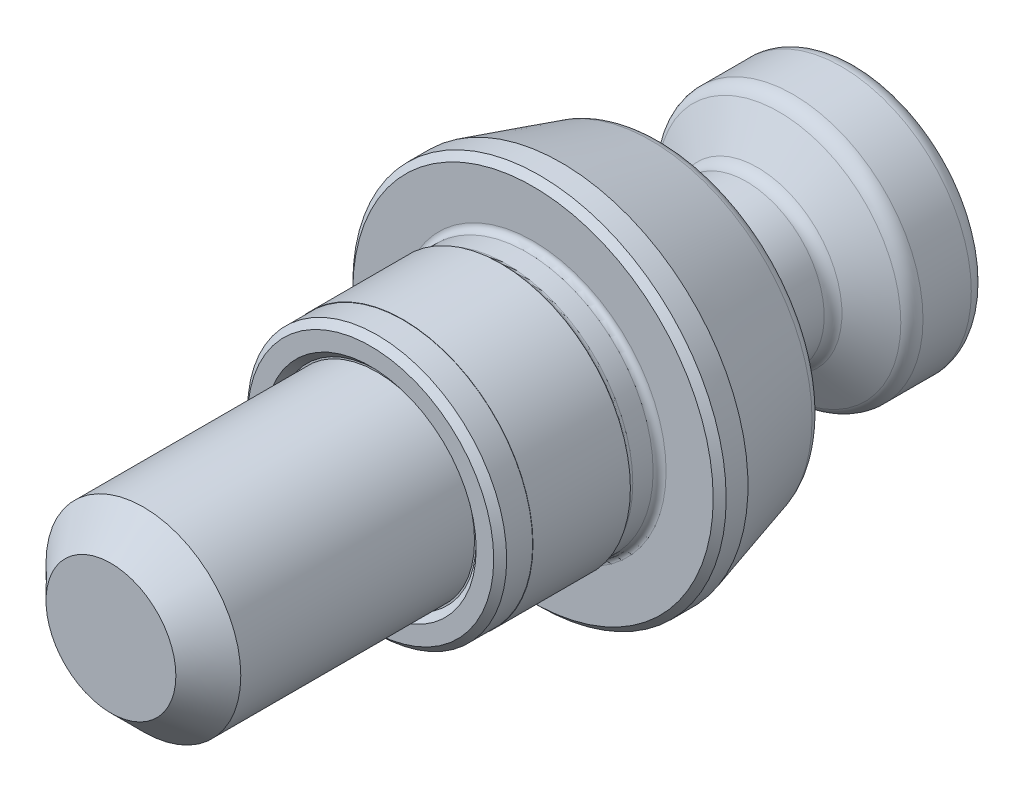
ISO-10303-21;
HEADER;
FILE_DESCRIPTION(('STEP AP214'),'2;1');
FILE_NAME('part.step','',(''),(''),'','','');
FILE_SCHEMA(('AUTOMOTIVE_DESIGN { 1 0 10303 214 1 1 1 1 }'));
ENDSEC;
DATA;
#1=APPLICATION_CONTEXT('core data for automotive mechanical design processes');
#2=APPLICATION_PROTOCOL_DEFINITION('international standard','automotive_design',2000,#1);
#3=PRODUCT_CONTEXT('',#1,'mechanical');
#4=PRODUCT('Part','Part','',(#3));
#5=PRODUCT_RELATED_PRODUCT_CATEGORY('part','',(#4));
#6=PRODUCT_DEFINITION_FORMATION('','',#4);
#7=PRODUCT_DEFINITION_CONTEXT('part definition',#1,'design');
#8=PRODUCT_DEFINITION('design','',#6,#7);
#9=PRODUCT_DEFINITION_SHAPE('','',#8);
#10=(LENGTH_UNIT() NAMED_UNIT(*) SI_UNIT(.MILLI.,.METRE.));
#11=(NAMED_UNIT(*) PLANE_ANGLE_UNIT() SI_UNIT($,.RADIAN.));
#12=(NAMED_UNIT(*) SI_UNIT($,.STERADIAN.) SOLID_ANGLE_UNIT());
#13=UNCERTAINTY_MEASURE_WITH_UNIT(LENGTH_MEASURE(1.E-05),#10,'distance_accuracy_value','');
#14=(GEOMETRIC_REPRESENTATION_CONTEXT(3) GLOBAL_UNCERTAINTY_ASSIGNED_CONTEXT((#13)) GLOBAL_UNIT_ASSIGNED_CONTEXT((#10,
#11,#12)) REPRESENTATION_CONTEXT('',''));
#15=CARTESIAN_POINT('',(0.,0.,0.));
#16=DIRECTION('',(0.,0.,1.));
#17=DIRECTION('',(1.,0.,0.));
#18=AXIS2_PLACEMENT_3D('',#15,#16,#17);
#19=CARTESIAN_POINT('',(0.,0.,0.));
#20=DIRECTION('',(0.,0.,1.));
#21=DIRECTION('',(1.,0.,0.));
#22=AXIS2_PLACEMENT_3D('',#19,#20,#21);
#23=CYLINDRICAL_SURFACE('',#22,4.05);
#24=CARTESIAN_POINT('',(0.,0.,-2.99580398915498));
#25=DIRECTION('',(0.,0.,-1.));
#26=DIRECTION('',(-1.,0.,0.));
#27=AXIS2_PLACEMENT_3D('',#24,#25,#26);
#28=CIRCLE('',#27,4.05);
#29=CARTESIAN_POINT('',(-4.05,0.,-2.99580398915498));
#30=VERTEX_POINT('',#29);
#31=EDGE_CURVE('E9',#30,#30,#28,.T.);
#32=ORIENTED_EDGE('',*,*,#31,.F.);
#33=EDGE_LOOP('',(#32));
#34=FACE_BOUND('',#33,.T.);
#35=CARTESIAN_POINT('',(0.,0.,-3.8));
#36=DIRECTION('',(0.,0.,-1.));
#37=DIRECTION('',(-1.,0.,0.));
#38=AXIS2_PLACEMENT_3D('',#35,#36,#37);
#39=CIRCLE('',#38,4.05);
#40=CARTESIAN_POINT('',(-4.05,0.,-3.8));
#41=VERTEX_POINT('',#40);
#42=EDGE_CURVE('E255',#41,#41,#39,.T.);
#43=ORIENTED_EDGE('',*,*,#42,.T.);
#44=EDGE_LOOP('',(#43));
#45=FACE_BOUND('',#44,.T.);
#46=ADVANCED_FACE('F14',(#34,#45),#23,.F.);
#47=CARTESIAN_POINT('',(0.,0.,0.2));
#48=DIRECTION('',(0.,0.,1.));
#49=DIRECTION('',(1.,0.,0.));
#50=AXIS2_PLACEMENT_3D('',#47,#48,#49);
#51=TOROIDAL_SURFACE('',#50,4.1,0.2);
#52=CARTESIAN_POINT('',(0.,0.,0.2));
#53=DIRECTION('',(0.,0.,1.));
#54=DIRECTION('',(1.,0.,0.));
#55=AXIS2_PLACEMENT_3D('',#52,#53,#54);
#56=CIRCLE('',#55,3.9);
#57=CARTESIAN_POINT('',(3.9,0.,0.2));
#58=VERTEX_POINT('',#57);
#59=EDGE_CURVE('E264',#58,#58,#56,.T.);
#60=ORIENTED_EDGE('',*,*,#59,.F.);
#61=EDGE_LOOP('',(#60));
#62=FACE_BOUND('',#61,.T.);
#63=CARTESIAN_POINT('',(0.,0.,0.));
#64=DIRECTION('',(0.,0.,1.));
#65=DIRECTION('',(1.,0.,0.));
#66=AXIS2_PLACEMENT_3D('',#63,#64,#65);
#67=CIRCLE('',#66,4.1);
#68=CARTESIAN_POINT('',(4.1,0.,0.));
#69=VERTEX_POINT('',#68);
#70=EDGE_CURVE('E258',#69,#69,#67,.F.);
#71=ORIENTED_EDGE('',*,*,#70,.F.);
#72=EDGE_LOOP('',(#71));
#73=FACE_BOUND('',#72,.T.);
#74=ADVANCED_FACE('F188',(#62,#73),#51,.F.);
#75=CARTESIAN_POINT('',(0.,4.,0.));
#76=DIRECTION('',(0.,0.,1.));
#77=DIRECTION('',(1.,0.,0.));
#78=AXIS2_PLACEMENT_3D('',#75,#76,#77);
#79=PLANE('',#78);
#80=ORIENTED_EDGE('',*,*,#70,.T.);
#81=EDGE_LOOP('',(#80));
#82=FACE_BOUND('',#81,.T.);
#83=CARTESIAN_POINT('',(0.,0.,0.));
#84=DIRECTION('',(0.,0.,1.));
#85=DIRECTION('',(1.,0.,0.));
#86=AXIS2_PLACEMENT_3D('',#83,#84,#85);
#87=CIRCLE('',#86,5.55);
#88=CARTESIAN_POINT('',(5.55,0.,0.));
#89=VERTEX_POINT('',#88);
#90=EDGE_CURVE('E243',#89,#89,#87,.T.);
#91=ORIENTED_EDGE('',*,*,#90,.T.);
#92=EDGE_LOOP('',(#91));
#93=FACE_BOUND('',#92,.T.);
#94=ADVANCED_FACE('F195',(#82,#93),#79,.T.);
#95=CARTESIAN_POINT('',(0.,0.,-0.199999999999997));
#96=DIRECTION('',(0.,0.,-1.));
#97=DIRECTION('',(-1.,0.,0.));
#98=AXIS2_PLACEMENT_3D('',#95,#96,#97);
#99=CONICAL_SURFACE('',#98,5.75,0.785398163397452);
#100=ORIENTED_EDGE('',*,*,#90,.F.);
#101=EDGE_LOOP('',(#100));
#102=FACE_BOUND('',#101,.T.);
#103=CARTESIAN_POINT('',(0.,0.,-0.199999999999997));
#104=DIRECTION('',(0.,0.,1.));
#105=DIRECTION('',(1.,0.,0.));
#106=AXIS2_PLACEMENT_3D('',#103,#104,#105);
#107=CIRCLE('',#106,5.75);
#108=CARTESIAN_POINT('',(5.75,0.,-0.199999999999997));
#109=VERTEX_POINT('',#108);
#110=EDGE_CURVE('E240',#109,#109,#107,.F.);
#111=ORIENTED_EDGE('',*,*,#110,.F.);
#112=EDGE_LOOP('',(#111));
#113=FACE_BOUND('',#112,.T.);
#114=ADVANCED_FACE('F472',(#102,#113),#99,.T.);
#115=CARTESIAN_POINT('',(0.,0.,0.));
#116=DIRECTION('',(0.,0.,-1.));
#117=DIRECTION('',(-1.,0.,0.));
#118=AXIS2_PLACEMENT_3D('',#115,#116,#117);
#119=CYLINDRICAL_SURFACE('',#118,5.75);
#120=ORIENTED_EDGE('',*,*,#110,.T.);
#121=EDGE_LOOP('',(#120));
#122=FACE_BOUND('',#121,.T.);
#123=CARTESIAN_POINT('',(0.,0.,-0.871853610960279));
#124=DIRECTION('',(0.,0.,-1.));
#125=DIRECTION('',(-1.,0.,0.));
#126=AXIS2_PLACEMENT_3D('',#123,#124,#125);
#127=CIRCLE('',#126,5.75);
#128=CARTESIAN_POINT('',(-5.75,0.,-0.871853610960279));
#129=VERTEX_POINT('',#128);
#130=EDGE_CURVE('E231',#129,#129,#127,.T.);
#131=ORIENTED_EDGE('',*,*,#130,.F.);
#132=EDGE_LOOP('',(#131));
#133=FACE_BOUND('',#132,.T.);
#134=ADVANCED_FACE('F475',(#122,#133),#119,.T.);
#135=CARTESIAN_POINT('',(0.,0.,-4.));
#136=DIRECTION('',(0.,0.,1.));
#137=DIRECTION('',(1.,0.,0.));
#138=AXIS2_PLACEMENT_3D('',#135,#136,#137);
#139=CONICAL_SURFACE('',#138,4.85301845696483,0.279252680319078);
#140=CARTESIAN_POINT('',(0.,0.,-3.63781867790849));
#141=DIRECTION('',(0.,0.,-1.));
#142=DIRECTION('',(-1.,0.,0.));
#143=AXIS2_PLACEMENT_3D('',#140,#141,#142);
#144=CIRCLE('',#143,4.95687227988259);
#145=CARTESIAN_POINT('',(-4.95687227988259,0.,-3.63781867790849));
#146=VERTEX_POINT('',#145);
#147=EDGE_CURVE('E237',#146,#146,#144,.F.);
#148=ORIENTED_EDGE('',*,*,#147,.T.);
#149=EDGE_LOOP('',(#148));
#150=FACE_BOUND('',#149,.T.);
#151=ORIENTED_EDGE('',*,*,#130,.T.);
#152=EDGE_LOOP('',(#151));
#153=FACE_BOUND('',#152,.T.);
#154=ADVANCED_FACE('F480',(#150,#153),#139,.T.);
#155=CARTESIAN_POINT('',(0.,0.,-3.5));
#156=DIRECTION('',(0.,0.,-1.));
#157=DIRECTION('',(-1.,0.,0.));
#158=AXIS2_PLACEMENT_3D('',#155,#156,#157);
#159=TOROIDAL_SURFACE('',#158,4.47624143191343,0.5);
#160=ORIENTED_EDGE('',*,*,#147,.F.);
#161=EDGE_LOOP('',(#160));
#162=FACE_BOUND('',#161,.T.);
#163=CARTESIAN_POINT('',(0.,0.,-4.));
#164=DIRECTION('',(0.,0.,-1.));
#165=DIRECTION('',(-1.,0.,0.));
#166=AXIS2_PLACEMENT_3D('',#163,#164,#165);
#167=CIRCLE('',#166,4.47624143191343);
#168=CARTESIAN_POINT('',(-4.47624143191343,0.,-4.));
#169=VERTEX_POINT('',#168);
#170=EDGE_CURVE('E234',#169,#169,#167,.T.);
#171=ORIENTED_EDGE('',*,*,#170,.F.);
#172=EDGE_LOOP('',(#171));
#173=FACE_BOUND('',#172,.T.);
#174=ADVANCED_FACE('F477',(#162,#173),#159,.T.);
#175=CARTESIAN_POINT('',(0.,3.05,-4.));
#176=DIRECTION('',(0.,0.,-1.));
#177=DIRECTION('',(-1.,0.,0.));
#178=AXIS2_PLACEMENT_3D('',#175,#176,#177);
#179=PLANE('',#178);
#180=CARTESIAN_POINT('',(0.,0.,-4.));
#181=DIRECTION('',(0.,0.,-1.));
#182=DIRECTION('',(-1.,0.,0.));
#183=AXIS2_PLACEMENT_3D('',#180,#181,#182);
#184=CIRCLE('',#183,4.25);
#185=CARTESIAN_POINT('',(-4.25,0.,-4.));
#186=VERTEX_POINT('',#185);
#187=EDGE_CURVE('E252',#186,#186,#184,.F.);
#188=ORIENTED_EDGE('',*,*,#187,.T.);
#189=EDGE_LOOP('',(#188));
#190=FACE_BOUND('',#189,.T.);
#191=ORIENTED_EDGE('',*,*,#170,.T.);
#192=EDGE_LOOP('',(#191));
#193=FACE_BOUND('',#192,.T.);
#194=ADVANCED_FACE('F465',(#190,#193),#179,.T.);
#195=CARTESIAN_POINT('',(0.,0.,-4.));
#196=DIRECTION('',(0.,0.,-1.));
#197=DIRECTION('',(-1.,0.,0.));
#198=AXIS2_PLACEMENT_3D('',#195,#196,#197);
#199=CONICAL_SURFACE('',#198,4.25,0.785398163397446);
#200=ORIENTED_EDGE('',*,*,#42,.F.);
#201=EDGE_LOOP('',(#200));
#202=FACE_BOUND('',#201,.T.);
#203=ORIENTED_EDGE('',*,*,#187,.F.);
#204=EDGE_LOOP('',(#203));
#205=FACE_BOUND('',#204,.T.);
#206=ADVANCED_FACE('F462',(#202,#205),#199,.F.);
#207=CARTESIAN_POINT('',(0.,0.,0.));
#208=DIRECTION('',(0.,0.,-1.));
#209=DIRECTION('',(-1.,0.,0.));
#210=AXIS2_PLACEMENT_3D('',#207,#208,#209);
#211=CYLINDRICAL_SURFACE('',#210,3.9);
#212=ORIENTED_EDGE('',*,*,#59,.T.);
#213=EDGE_LOOP('',(#212));
#214=FACE_BOUND('',#213,.T.);
#215=CARTESIAN_POINT('',(0.,0.,0.826794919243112));
#216=DIRECTION('',(0.,0.,1.));
#217=DIRECTION('',(1.,0.,0.));
#218=AXIS2_PLACEMENT_3D('',#215,#216,#217);
#219=CIRCLE('',#218,3.9);
#220=CARTESIAN_POINT('',(3.9,0.,0.826794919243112));
#221=VERTEX_POINT('',#220);
#222=EDGE_CURVE('E261',#221,#221,#219,.F.);
#223=ORIENTED_EDGE('',*,*,#222,.T.);
#224=EDGE_LOOP('',(#223));
#225=FACE_BOUND('',#224,.T.);
#226=ADVANCED_FACE('F459',(#214,#225),#211,.T.);
#227=CARTESIAN_POINT('',(0.,0.,0.826794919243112));
#228=DIRECTION('',(0.,0.,1.));
#229=DIRECTION('',(1.,0.,0.));
#230=AXIS2_PLACEMENT_3D('',#227,#228,#229);
#231=TOROIDAL_SURFACE('',#230,4.1,0.2);
#232=CARTESIAN_POINT('',(0.,0.,1.));
#233=DIRECTION('',(0.,0.,-1.));
#234=DIRECTION('',(-1.,0.,0.));
#235=AXIS2_PLACEMENT_3D('',#232,#233,#234);
#236=CIRCLE('',#235,4.);
#237=CARTESIAN_POINT('',(-4.,0.,1.));
#238=VERTEX_POINT('',#237);
#239=EDGE_CURVE('E216',#238,#238,#236,.T.);
#240=ORIENTED_EDGE('',*,*,#239,.T.);
#241=EDGE_LOOP('',(#240));
#242=FACE_BOUND('',#241,.T.);
#243=ORIENTED_EDGE('',*,*,#222,.F.);
#244=EDGE_LOOP('',(#243));
#245=FACE_BOUND('',#244,.T.);
#246=ADVANCED_FACE('F456',(#242,#245),#231,.F.);
#247=CARTESIAN_POINT('',(0.,0.,0.));
#248=DIRECTION('',(0.,0.,-1.));
#249=DIRECTION('',(-1.,0.,0.));
#250=AXIS2_PLACEMENT_3D('',#247,#248,#249);
#251=CYLINDRICAL_SURFACE('',#250,4.);
#252=CARTESIAN_POINT('',(0.,0.,4.));
#253=DIRECTION('',(0.,0.,-1.));
#254=DIRECTION('',(-1.,0.,0.));
#255=AXIS2_PLACEMENT_3D('',#252,#253,#254);
#256=CIRCLE('',#255,4.);
#257=CARTESIAN_POINT('',(-4.,0.,4.));
#258=VERTEX_POINT('',#257);
#259=EDGE_CURVE('E228',#258,#258,#256,.T.);
#260=ORIENTED_EDGE('',*,*,#259,.T.);
#261=EDGE_LOOP('',(#260));
#262=FACE_BOUND('',#261,.T.);
#263=ORIENTED_EDGE('',*,*,#239,.F.);
#264=EDGE_LOOP('',(#263));
#265=FACE_BOUND('',#264,.T.);
#266=ADVANCED_FACE('F458',(#262,#265),#251,.T.);
#267=CARTESIAN_POINT('',(0.,-4.,4.));
#268=DIRECTION('',(0.,0.,1.));
#269=DIRECTION('',(1.,0.,0.));
#270=AXIS2_PLACEMENT_3D('',#267,#268,#269);
#271=PLANE('',#270);
#272=CARTESIAN_POINT('',(0.,0.,4.));
#273=DIRECTION('',(0.,0.,-1.));
#274=DIRECTION('',(-1.,0.,0.));
#275=AXIS2_PLACEMENT_3D('',#272,#273,#274);
#276=CIRCLE('',#275,3.99);
#277=CARTESIAN_POINT('',(-3.99,0.,4.));
#278=VERTEX_POINT('',#277);
#279=EDGE_CURVE('E220',#278,#278,#276,.T.);
#280=ORIENTED_EDGE('',*,*,#279,.T.);
#281=EDGE_LOOP('',(#280));
#282=FACE_BOUND('',#281,.T.);
#283=ORIENTED_EDGE('',*,*,#259,.F.);
#284=EDGE_LOOP('',(#283));
#285=FACE_BOUND('',#284,.T.);
#286=ADVANCED_FACE('F484',(#282,#285),#271,.T.);
#287=CARTESIAN_POINT('',(0.,0.,0.));
#288=DIRECTION('',(0.,0.,-1.));
#289=DIRECTION('',(-1.,0.,0.));
#290=AXIS2_PLACEMENT_3D('',#287,#288,#289);
#291=CYLINDRICAL_SURFACE('',#290,3.99);
#292=CARTESIAN_POINT('',(0.,0.,4.8));
#293=DIRECTION('',(0.,0.,1.));
#294=DIRECTION('',(1.,0.,0.));
#295=AXIS2_PLACEMENT_3D('',#292,#293,#294);
#296=CIRCLE('',#295,3.99);
#297=CARTESIAN_POINT('',(3.99,0.,4.8));
#298=VERTEX_POINT('',#297);
#299=EDGE_CURVE('E246',#298,#298,#296,.F.);
#300=ORIENTED_EDGE('',*,*,#299,.T.);
#301=EDGE_LOOP('',(#300));
#302=FACE_BOUND('',#301,.T.);
#303=ORIENTED_EDGE('',*,*,#279,.F.);
#304=EDGE_LOOP('',(#303));
#305=FACE_BOUND('',#304,.T.);
#306=ADVANCED_FACE('F470',(#302,#305),#291,.T.);
#307=CARTESIAN_POINT('',(0.,0.,4.8));
#308=DIRECTION('',(0.,0.,-1.));
#309=DIRECTION('',(-1.,0.,0.));
#310=AXIS2_PLACEMENT_3D('',#307,#308,#309);
#311=CONICAL_SURFACE('',#310,3.99,0.785398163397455);
#312=CARTESIAN_POINT('',(0.,0.,5.));
#313=DIRECTION('',(0.,0.,1.));
#314=DIRECTION('',(1.,0.,0.));
#315=AXIS2_PLACEMENT_3D('',#312,#313,#314);
#316=CIRCLE('',#315,3.79);
#317=CARTESIAN_POINT('',(3.79,0.,5.));
#318=VERTEX_POINT('',#317);
#319=EDGE_CURVE('E249',#318,#318,#316,.T.);
#320=ORIENTED_EDGE('',*,*,#319,.F.);
#321=EDGE_LOOP('',(#320));
#322=FACE_BOUND('',#321,.T.);
#323=ORIENTED_EDGE('',*,*,#299,.F.);
#324=EDGE_LOOP('',(#323));
#325=FACE_BOUND('',#324,.T.);
#326=ADVANCED_FACE('F467',(#322,#325),#311,.T.);
#327=CARTESIAN_POINT('',(0.,3.05,5.));
#328=DIRECTION('',(0.,0.,1.));
#329=DIRECTION('',(1.,0.,0.));
#330=AXIS2_PLACEMENT_3D('',#327,#328,#329);
#331=PLANE('',#330);
#332=CARTESIAN_POINT('',(0.,0.,5.));
#333=DIRECTION('',(0.,0.,1.));
#334=DIRECTION('',(1.,0.,0.));
#335=AXIS2_PLACEMENT_3D('',#332,#333,#334);
#336=CIRCLE('',#335,3.25);
#337=CARTESIAN_POINT('',(3.25,0.,5.));
#338=VERTEX_POINT('',#337);
#339=EDGE_CURVE('E270',#338,#338,#336,.F.);
#340=ORIENTED_EDGE('',*,*,#339,.T.);
#341=EDGE_LOOP('',(#340));
#342=FACE_BOUND('',#341,.T.);
#343=ORIENTED_EDGE('',*,*,#319,.T.);
#344=EDGE_LOOP('',(#343));
#345=FACE_BOUND('',#344,.T.);
#346=ADVANCED_FACE('F454',(#342,#345),#331,.T.);
#347=CARTESIAN_POINT('',(0.,0.,5.));
#348=DIRECTION('',(0.,0.,1.));
#349=DIRECTION('',(1.,0.,0.));
#350=AXIS2_PLACEMENT_3D('',#347,#348,#349);
#351=CONICAL_SURFACE('',#350,3.25,0.785398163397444);
#352=CARTESIAN_POINT('',(0.,0.,4.8));
#353=DIRECTION('',(0.,0.,1.));
#354=DIRECTION('',(1.,0.,0.));
#355=AXIS2_PLACEMENT_3D('',#352,#353,#354);
#356=CIRCLE('',#355,3.05);
#357=CARTESIAN_POINT('',(3.05,0.,4.8));
#358=VERTEX_POINT('',#357);
#359=EDGE_CURVE('E267',#358,#358,#356,.T.);
#360=ORIENTED_EDGE('',*,*,#359,.F.);
#361=EDGE_LOOP('',(#360));
#362=FACE_BOUND('',#361,.T.);
#363=ORIENTED_EDGE('',*,*,#339,.F.);
#364=EDGE_LOOP('',(#363));
#365=FACE_BOUND('',#364,.T.);
#366=ADVANCED_FACE('F299',(#362,#365),#351,.F.);
#367=CARTESIAN_POINT('',(0.,0.,4.8));
#368=DIRECTION('',(0.,0.,1.));
#369=DIRECTION('',(1.,0.,0.));
#370=AXIS2_PLACEMENT_3D('',#367,#368,#369);
#371=PLANE('',#370);
#372=CARTESIAN_POINT('',(0.,0.,4.8));
#373=DIRECTION('',(0.,0.,1.));
#374=DIRECTION('',(1.,0.,0.));
#375=AXIS2_PLACEMENT_3D('',#372,#373,#374);
#376=CIRCLE('',#375,3.);
#377=CARTESIAN_POINT('',(3.,0.,4.8));
#378=VERTEX_POINT('',#377);
#379=EDGE_CURVE('E102',#378,#378,#376,.T.);
#380=ORIENTED_EDGE('',*,*,#379,.F.);
#381=EDGE_LOOP('',(#380));
#382=FACE_BOUND('',#381,.T.);
#383=ORIENTED_EDGE('',*,*,#359,.T.);
#384=EDGE_LOOP('',(#383));
#385=FACE_BOUND('',#384,.T.);
#386=ADVANCED_FACE('F290',(#382,#385),#371,.T.);
#387=CARTESIAN_POINT('',(0.,3.,13.));
#388=DIRECTION('',(0.,0.,1.));
#389=DIRECTION('',(1.,0.,0.));
#390=AXIS2_PLACEMENT_3D('',#387,#388,#389);
#391=PLANE('',#390);
#392=CARTESIAN_POINT('',(0.,0.,13.));
#393=DIRECTION('',(0.,0.,1.));
#394=DIRECTION('',(1.,0.,0.));
#395=AXIS2_PLACEMENT_3D('',#392,#393,#394);
#396=CIRCLE('',#395,2.);
#397=CARTESIAN_POINT('',(2.,0.,13.));
#398=VERTEX_POINT('',#397);
#399=EDGE_CURVE('E351',#398,#398,#396,.T.);
#400=ORIENTED_EDGE('',*,*,#399,.T.);
#401=EDGE_LOOP('',(#400));
#402=FACE_BOUND('',#401,.T.);
#403=ADVANCED_FACE('F284',(#402),#391,.T.);
#404=CARTESIAN_POINT('',(0.,0.,12.));
#405=DIRECTION('',(0.,0.,-1.));
#406=DIRECTION('',(-1.,0.,0.));
#407=AXIS2_PLACEMENT_3D('',#404,#405,#406);
#408=CONICAL_SURFACE('',#407,3.,0.785398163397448);
#409=ORIENTED_EDGE('',*,*,#399,.F.);
#410=EDGE_LOOP('',(#409));
#411=FACE_BOUND('',#410,.T.);
#412=CARTESIAN_POINT('',(0.,0.,12.));
#413=DIRECTION('',(0.,0.,1.));
#414=DIRECTION('',(1.,0.,0.));
#415=AXIS2_PLACEMENT_3D('',#412,#413,#414);
#416=CIRCLE('',#415,3.);
#417=CARTESIAN_POINT('',(3.,0.,12.));
#418=VERTEX_POINT('',#417);
#419=EDGE_CURVE('E343',#418,#418,#416,.F.);
#420=ORIENTED_EDGE('',*,*,#419,.F.);
#421=EDGE_LOOP('',(#420));
#422=FACE_BOUND('',#421,.T.);
#423=ADVANCED_FACE('F288',(#411,#422),#408,.T.);
#424=CARTESIAN_POINT('',(0.,0.,0.));
#425=DIRECTION('',(0.,0.,-1.));
#426=DIRECTION('',(-1.,0.,0.));
#427=AXIS2_PLACEMENT_3D('',#424,#425,#426);
#428=CYLINDRICAL_SURFACE('',#427,3.);
#429=ORIENTED_EDGE('',*,*,#379,.T.);
#430=EDGE_LOOP('',(#429));
#431=FACE_BOUND('',#430,.T.);
#432=ORIENTED_EDGE('',*,*,#419,.T.);
#433=EDGE_LOOP('',(#432));
#434=FACE_BOUND('',#433,.T.);
#435=ADVANCED_FACE('F281',(#431,#434),#428,.T.);
#436=CARTESIAN_POINT('',(0.,4.,-2.7));
#437=DIRECTION('',(1.,0.,0.));
#438=DIRECTION('',(0.,0.,-1.));
#439=AXIS2_PLACEMENT_3D('',#436,#437,#438);
#440=ELLIPSE('',#439,0.3,0.3);
#441=CARTESIAN_POINT('',(0.,0.,-2.7));
#442=DIRECTION('',(0.,0.,-1.));
#443=AXIS1_PLACEMENT('',#441,#442);
#444=SURFACE_OF_REVOLUTION('',#440,#443);
#445=ORIENTED_EDGE('',*,*,#31,.T.);
#446=EDGE_LOOP('',(#445));
#447=FACE_BOUND('',#446,.T.);
#448=CARTESIAN_POINT('',(0.,0.,-2.40419601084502));
#449=DIRECTION('',(0.,0.,-1.));
#450=DIRECTION('',(-1.,0.,0.));
#451=AXIS2_PLACEMENT_3D('',#448,#449,#450);
#452=CIRCLE('',#451,4.05);
#453=CARTESIAN_POINT('',(-4.05,0.,-2.40419601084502));
#454=VERTEX_POINT('',#453);
#455=EDGE_CURVE('E22',#454,#454,#452,.F.);
#456=ORIENTED_EDGE('',*,*,#455,.T.);
#457=EDGE_LOOP('',(#456));
#458=FACE_BOUND('',#457,.T.);
#459=ADVANCED_FACE('F90',(#447,#458),#444,.F.);
#460=CARTESIAN_POINT('',(0.,0.,-7.));
#461=DIRECTION('',(0.,0.,-1.));
#462=DIRECTION('',(-1.,0.,0.));
#463=AXIS2_PLACEMENT_3D('',#460,#461,#462);
#464=CONICAL_SURFACE('',#463,1.25,1.02974425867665);
#465=CARTESIAN_POINT('',(0.,0.,-6.24892422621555));
#466=VERTEX_POINT('',#465);
#467=VERTEX_LOOP('',#466);
#468=FACE_BOUND('',#467,.T.);
#469=CARTESIAN_POINT('',(0.,0.,-7.));
#470=DIRECTION('',(0.,0.,-1.));
#471=DIRECTION('',(-1.,0.,0.));
#472=AXIS2_PLACEMENT_3D('',#469,#470,#471);
#473=CIRCLE('',#472,1.25);
#474=CARTESIAN_POINT('',(-1.25,0.,-7.));
#475=VERTEX_POINT('',#474);
#476=EDGE_CURVE('E94',#475,#475,#473,.T.);
#477=ORIENTED_EDGE('',*,*,#476,.T.);
#478=EDGE_LOOP('',(#477));
#479=FACE_BOUND('',#478,.T.);
#480=ADVANCED_FACE('F86',(#468,#479),#464,.F.);
#481=CARTESIAN_POINT('',(0.,0.,-10.));
#482=DIRECTION('',(0.,0.,-1.));
#483=DIRECTION('',(-1.,0.,0.));
#484=AXIS2_PLACEMENT_3D('',#481,#482,#483);
#485=CYLINDRICAL_SURFACE('',#484,1.25);
#486=CARTESIAN_POINT('',(0.,0.,-8.));
#487=DIRECTION('',(0.,0.,-1.));
#488=DIRECTION('',(-1.,0.,0.));
#489=AXIS2_PLACEMENT_3D('',#486,#487,#488);
#490=CIRCLE('',#489,1.25);
#491=CARTESIAN_POINT('',(-1.25,0.,-8.));
#492=VERTEX_POINT('',#491);
#493=CARTESIAN_POINT('',(-0.625,1.08253175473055,-8.));
#494=VERTEX_POINT('',#493);
#495=EDGE_CURVE('E100',#492,#494,#490,.T.);
#496=ORIENTED_EDGE('',*,*,#495,.T.);
#497=CARTESIAN_POINT('',(0.625,1.08253175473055,-8.));
#498=VERTEX_POINT('',#497);
#499=EDGE_CURVE('E96',#494,#498,#490,.T.);
#500=ORIENTED_EDGE('',*,*,#499,.T.);
#501=CARTESIAN_POINT('',(1.25,0.,-8.));
#502=VERTEX_POINT('',#501);
#503=EDGE_CURVE('E442',#498,#502,#490,.T.);
#504=ORIENTED_EDGE('',*,*,#503,.T.);
#505=CARTESIAN_POINT('',(0.625,-1.08253175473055,-8.));
#506=VERTEX_POINT('',#505);
#507=EDGE_CURVE('E443',#502,#506,#490,.T.);
#508=ORIENTED_EDGE('',*,*,#507,.T.);
#509=CARTESIAN_POINT('',(-0.625,-1.08253175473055,-8.));
#510=VERTEX_POINT('',#509);
#511=EDGE_CURVE('E29',#506,#510,#490,.T.);
#512=ORIENTED_EDGE('',*,*,#511,.T.);
#513=EDGE_CURVE('E98',#510,#492,#490,.T.);
#514=ORIENTED_EDGE('',*,*,#513,.T.);
#515=EDGE_LOOP('',(#496,#500,#504,#508,#512,#514));
#516=FACE_BOUND('',#515,.T.);
#517=ORIENTED_EDGE('',*,*,#476,.F.);
#518=EDGE_LOOP('',(#517));
#519=FACE_BOUND('',#518,.T.);
#520=ADVANCED_FACE('F89',(#516,#519),#485,.F.);
#521=CARTESIAN_POINT('',(0.,0.,-8.));
#522=DIRECTION('',(0.,0.,-1.));
#523=DIRECTION('',(-1.,0.,0.));
#524=AXIS2_PLACEMENT_3D('',#521,#522,#523);
#525=PLANE('',#524);
#526=ORIENTED_EDGE('',*,*,#503,.F.);
#527=DIRECTION('',(0.866025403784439,-0.5,0.));
#528=VECTOR('',#527,1.);
#529=CARTESIAN_POINT('',(0.,1.44337567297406,-8.));
#530=LINE('',#529,#528);
#531=CARTESIAN_POINT('',(1.25,0.721687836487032,-8.));
#532=VERTEX_POINT('',#531);
#533=EDGE_CURVE('E416',#498,#532,#530,.T.);
#534=ORIENTED_EDGE('',*,*,#533,.T.);
#535=DIRECTION('',(0.,-1.,0.));
#536=VECTOR('',#535,1.);
#537=CARTESIAN_POINT('',(1.25,0.721687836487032,-8.));
#538=LINE('',#537,#536);
#539=EDGE_CURVE('E415',#532,#502,#538,.T.);
#540=ORIENTED_EDGE('',*,*,#539,.T.);
#541=EDGE_LOOP('',(#526,#534,#540));
#542=FACE_BOUND('',#541,.T.);
#543=ADVANCED_FACE('F446',(#542),#525,.T.);
#544=ORIENTED_EDGE('',*,*,#507,.F.);
#545=CARTESIAN_POINT('',(1.25,-0.721687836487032,-8.));
#546=VERTEX_POINT('',#545);
#547=EDGE_CURVE('E413',#502,#546,#538,.T.);
#548=ORIENTED_EDGE('',*,*,#547,.T.);
#549=DIRECTION('',(-0.866025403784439,-0.5,0.));
#550=VECTOR('',#549,1.);
#551=CARTESIAN_POINT('',(1.25,-0.721687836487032,-8.));
#552=LINE('',#551,#550);
#553=EDGE_CURVE('E410',#546,#506,#552,.T.);
#554=ORIENTED_EDGE('',*,*,#553,.T.);
#555=EDGE_LOOP('',(#544,#548,#554));
#556=FACE_BOUND('',#555,.T.);
#557=ADVANCED_FACE('F450',(#556),#525,.T.);
#558=ORIENTED_EDGE('',*,*,#511,.F.);
#559=CARTESIAN_POINT('',(0.,-1.44337567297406,-8.));
#560=VERTEX_POINT('',#559);
#561=EDGE_CURVE('E426',#506,#560,#552,.T.);
#562=ORIENTED_EDGE('',*,*,#561,.T.);
#563=DIRECTION('',(-0.866025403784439,0.5,0.));
#564=VECTOR('',#563,1.);
#565=CARTESIAN_POINT('',(0.,-1.44337567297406,-8.));
#566=LINE('',#565,#564);
#567=EDGE_CURVE('E428',#560,#510,#566,.T.);
#568=ORIENTED_EDGE('',*,*,#567,.T.);
#569=EDGE_LOOP('',(#558,#562,#568));
#570=FACE_BOUND('',#569,.T.);
#571=ADVANCED_FACE('F623',(#570),#525,.T.);
#572=ORIENTED_EDGE('',*,*,#513,.F.);
#573=CARTESIAN_POINT('',(-1.25,-0.721687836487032,-8.));
#574=VERTEX_POINT('',#573);
#575=EDGE_CURVE('E427',#510,#574,#566,.T.);
#576=ORIENTED_EDGE('',*,*,#575,.T.);
#577=DIRECTION('',(0.,1.,0.));
#578=VECTOR('',#577,1.);
#579=CARTESIAN_POINT('',(-1.25,-0.721687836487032,-8.));
#580=LINE('',#579,#578);
#581=EDGE_CURVE('E373',#574,#492,#580,.T.);
#582=ORIENTED_EDGE('',*,*,#581,.T.);
#583=EDGE_LOOP('',(#572,#576,#582));
#584=FACE_BOUND('',#583,.T.);
#585=ADVANCED_FACE('F133',(#584),#525,.T.);
#586=ORIENTED_EDGE('',*,*,#495,.F.);
#587=CARTESIAN_POINT('',(-1.25,0.721687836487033,-8.));
#588=VERTEX_POINT('',#587);
#589=EDGE_CURVE('E378',#492,#588,#580,.T.);
#590=ORIENTED_EDGE('',*,*,#589,.T.);
#591=DIRECTION('',(0.866025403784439,0.5,0.));
#592=VECTOR('',#591,1.);
#593=CARTESIAN_POINT('',(-1.25,0.721687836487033,-8.));
#594=LINE('',#593,#592);
#595=EDGE_CURVE('E419',#588,#494,#594,.T.);
#596=ORIENTED_EDGE('',*,*,#595,.T.);
#597=EDGE_LOOP('',(#586,#590,#596));
#598=FACE_BOUND('',#597,.T.);
#599=ADVANCED_FACE('F441',(#598),#525,.T.);
#600=ORIENTED_EDGE('',*,*,#499,.F.);
#601=CARTESIAN_POINT('',(0.,1.44337567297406,-8.));
#602=VERTEX_POINT('',#601);
#603=EDGE_CURVE('E368',#494,#602,#594,.T.);
#604=ORIENTED_EDGE('',*,*,#603,.T.);
#605=EDGE_CURVE('E371',#602,#498,#530,.T.);
#606=ORIENTED_EDGE('',*,*,#605,.T.);
#607=EDGE_LOOP('',(#600,#604,#606));
#608=FACE_BOUND('',#607,.T.);
#609=ADVANCED_FACE('F423',(#608),#525,.T.);
#610=CARTESIAN_POINT('',(0.,1.44337567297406,-8.));
#611=DIRECTION('',(0.5,0.866025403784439,0.));
#612=DIRECTION('',(-0.866025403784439,0.5,0.));
#613=AXIS2_PLACEMENT_3D('',#610,#611,#612);
#614=PLANE('',#613);
#615=ORIENTED_EDGE('',*,*,#533,.F.);
#616=ORIENTED_EDGE('',*,*,#605,.F.);
#617=DIRECTION('',(0.,0.,-1.));
#618=VECTOR('',#617,1.);
#619=CARTESIAN_POINT('',(0.,1.44337567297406,-8.));
#620=LINE('',#619,#618);
#621=CARTESIAN_POINT('',(0.,1.44337567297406,-9.85183787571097));
#622=VERTEX_POINT('',#621);
#623=EDGE_CURVE('E363',#602,#622,#620,.T.);
#624=ORIENTED_EDGE('',*,*,#623,.T.);
#625=CARTESIAN_POINT('',(1.2502,0.721572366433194,-9.851904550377));
#626=CARTESIAN_POINT('',(1.19526669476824,0.753288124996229,-9.83358379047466));
#627=CARTESIAN_POINT('',(1.13985921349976,0.785277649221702,-9.81692118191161));
#628=CARTESIAN_POINT('',(1.02808463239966,0.849810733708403,-9.78783517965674));
#629=CARTESIAN_POINT('',(0.97171554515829,0.882355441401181,-9.77542207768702));
#630=CARTESIAN_POINT('',(0.859676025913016,0.947041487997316,-9.75609756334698));
#631=CARTESIAN_POINT('',(0.804022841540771,0.979172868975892,-9.7490575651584));
#632=CARTESIAN_POINT('',(0.69245434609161,1.04358696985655,-9.7406503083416));
#633=CARTESIAN_POINT('',(0.636539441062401,1.07586945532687,-9.7392760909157));
#634=CARTESIAN_POINT('',(0.532042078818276,1.13620103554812,-9.74212121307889));
#635=CARTESIAN_POINT('',(0.483444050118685,1.16425912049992,-9.74564197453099));
#636=CARTESIAN_POINT('',(0.386564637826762,1.22019247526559,-9.75680498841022));
#637=CARTESIAN_POINT('',(0.338283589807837,1.24806755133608,-9.76445106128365));
#638=CARTESIAN_POINT('',(0.241204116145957,1.30411641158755,-9.7835673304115));
#639=CARTESIAN_POINT('',(0.1924179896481,1.33228309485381,-9.79511863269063));
#640=CARTESIAN_POINT('',(0.0955737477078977,1.38819614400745,-9.82133619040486));
#641=CARTESIAN_POINT('',(0.0475143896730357,1.41594322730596,-9.83599627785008));
#642=CARTESIAN_POINT('',(-0.00019999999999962,1.4434911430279,-9.851904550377));
#643=B_SPLINE_CURVE_WITH_KNOTS('',3,(#625,#626,#627,#628,#629,#630,#631,#632,#633,#634,#635,
#636,#637,#638,#639,#640,#641,#642),.UNSPECIFIED.,.F.,.F.,(4,2,2,2,2,2,2,2,4),(0.,
0.19815082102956,0.396778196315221,0.590488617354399,0.783961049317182,0.952480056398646,
1.1211553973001,1.2935743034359,1.4656542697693),.UNSPECIFIED.);
#644=CARTESIAN_POINT('',(1.25,0.721687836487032,-9.85183787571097));
#645=VERTEX_POINT('',#644);
#646=EDGE_CURVE('E138',#645,#622,#643,.T.);
#647=ORIENTED_EDGE('',*,*,#646,.F.);
#648=DIRECTION('',(0.,0.,-1.));
#649=VECTOR('',#648,1.);
#650=CARTESIAN_POINT('',(1.25,0.721687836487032,-8.));
#651=LINE('',#650,#649);
#652=EDGE_CURVE('E372',#532,#645,#651,.T.);
#653=ORIENTED_EDGE('',*,*,#652,.F.);
#654=EDGE_LOOP('',(#615,#616,#624,#647,#653));
#655=FACE_BOUND('',#654,.T.);
#656=ADVANCED_FACE('F184',(#655),#614,.F.);
#657=CARTESIAN_POINT('',(1.25,0.721687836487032,-8.));
#658=DIRECTION('',(1.,0.,0.));
#659=DIRECTION('',(0.,1.,0.));
#660=AXIS2_PLACEMENT_3D('',#657,#658,#659);
#661=PLANE('',#660);
#662=ORIENTED_EDGE('',*,*,#547,.F.);
#663=ORIENTED_EDGE('',*,*,#539,.F.);
#664=ORIENTED_EDGE('',*,*,#652,.T.);
#665=CARTESIAN_POINT('',(1.25,-1.90256496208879,-10.3328172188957));
#666=CARTESIAN_POINT('',(1.25,-1.84823997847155,-10.3066115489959));
#667=CARTESIAN_POINT('',(1.25,-1.79378640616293,-10.280667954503));
#668=CARTESIAN_POINT('',(1.25,-1.68455324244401,-10.2294529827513));
#669=CARTESIAN_POINT('',(1.25,-1.6297735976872,-10.2041817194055));
#670=CARTESIAN_POINT('',(1.25,-1.51951971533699,-10.1543246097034));
#671=CARTESIAN_POINT('',(1.25,-1.46404329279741,-10.1297435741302));
#672=CARTESIAN_POINT('',(1.25,-1.35263700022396,-10.0816380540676));
#673=CARTESIAN_POINT('',(1.25,-1.2967071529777,-10.0581135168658));
#674=CARTESIAN_POINT('',(1.25,-1.1826830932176,-10.0117404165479));
#675=CARTESIAN_POINT('',(1.25,-1.12457287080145,-9.98893070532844));
#676=CARTESIAN_POINT('',(1.25,-1.0076715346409,-9.94513453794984));
#677=CARTESIAN_POINT('',(1.25,-0.948880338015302,-9.9241483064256));
#678=CARTESIAN_POINT('',(1.25,-0.771563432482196,-9.86477175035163));
#679=CARTESIAN_POINT('',(1.25,-0.651785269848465,-9.8298321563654));
#680=CARTESIAN_POINT('',(1.25,-0.469831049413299,-9.78882272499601));
#681=CARTESIAN_POINT('',(1.25,-0.408943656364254,-9.77706720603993));
#682=CARTESIAN_POINT('',(1.25,-0.286447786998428,-9.75811512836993));
#683=CARTESIAN_POINT('',(1.25,-0.224839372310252,-9.75091818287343));
#684=CARTESIAN_POINT('',(1.25,-0.102000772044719,-9.74174925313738));
#685=CARTESIAN_POINT('',(1.25,-0.0407755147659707,-9.73971295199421));
#686=CARTESIAN_POINT('',(1.25,0.0816245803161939,-9.74086447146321));
#687=CARTESIAN_POINT('',(1.25,0.142799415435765,-9.74405255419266));
#688=CARTESIAN_POINT('',(1.25,0.291715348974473,-9.75789155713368));
#689=CARTESIAN_POINT('',(1.25,0.37920756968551,-9.77122490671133));
#690=CARTESIAN_POINT('',(1.25,0.552549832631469,-9.80614903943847));
#691=CARTESIAN_POINT('',(1.25,0.638397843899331,-9.82774942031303));
#692=CARTESIAN_POINT('',(1.25,0.766820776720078,-9.8648901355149));
#693=CARTESIAN_POINT('',(1.25,0.810054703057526,-9.87823855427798));
#694=CARTESIAN_POINT('',(1.25,0.896072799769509,-9.90623260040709));
#695=CARTESIAN_POINT('',(1.25,0.938857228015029,-9.92087743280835));
#696=CARTESIAN_POINT('',(1.25,1.02403164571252,-9.95124588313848));
#697=CARTESIAN_POINT('',(1.25,1.06642169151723,-9.96696934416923));
#698=CARTESIAN_POINT('',(1.25,1.15086283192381,-9.99931859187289));
#699=CARTESIAN_POINT('',(1.25,1.1929138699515,-10.0159445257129));
#700=CARTESIAN_POINT('',(1.25,1.30342673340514,-10.0607826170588));
#701=CARTESIAN_POINT('',(1.25,1.37163332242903,-10.0896232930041));
#702=CARTESIAN_POINT('',(1.25,1.50739270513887,-10.1488088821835));
#703=CARTESIAN_POINT('',(1.25,1.57494543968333,-10.1791539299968));
#704=CARTESIAN_POINT('',(1.25,1.77685071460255,-10.2718984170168));
#705=CARTESIAN_POINT('',(1.25,1.91042177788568,-10.3359952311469));
#706=CARTESIAN_POINT('',(1.25,2.17639034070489,-10.4669997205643));
#707=CARTESIAN_POINT('',(1.25,2.30878596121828,-10.5339111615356));
#708=CARTESIAN_POINT('',(1.25,2.5726415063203,-10.6695014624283));
#709=CARTESIAN_POINT('',(1.25,2.70410157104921,-10.7381800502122));
#710=CARTESIAN_POINT('',(1.25,2.95325951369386,-10.8698094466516));
#711=CARTESIAN_POINT('',(1.25,3.07101813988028,-10.9326456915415));
#712=CARTESIAN_POINT('',(1.25,3.30615527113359,-11.0590374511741));
#713=CARTESIAN_POINT('',(1.25,3.42353375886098,-11.1225929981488));
#714=CARTESIAN_POINT('',(1.25,3.657665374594,-11.2500583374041));
#715=CARTESIAN_POINT('',(1.25,3.77441933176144,-11.3139666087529));
#716=CARTESIAN_POINT('',(1.25,4.0076909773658,-11.4421963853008));
#717=CARTESIAN_POINT('',(1.25,4.12420867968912,-11.5065178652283));
#718=CARTESIAN_POINT('',(1.25,4.24064238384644,-11.5709901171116));
#719=B_SPLINE_CURVE_WITH_KNOTS('',3,(#665,#666,#667,#668,#669,#670,#671,#672,#673,#674,#675,
#676,#677,#678,#679,#680,#681,#682,#683,#684,#685,#686,#687,#688,#689,#690,#691,#692,#693,#694,
#695,#696,#697,#698,#699,#700,#701,#702,#703,#704,#705,#706,#707,#708,#709,#710,#711,#712,#713,
#714,#715,#716,#717,#718),.UNSPECIFIED.,.F.,.F.,(4,2,2,2,2,2,2,2,2,2,2,2,2,2,2,2,2,2,2,2,2,2,2,
2,2,2,4),(0.,0.180948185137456,0.361926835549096,0.54395243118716,0.725968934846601,
0.913216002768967,1.10048610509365,1.47402004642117,1.65991873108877,1.84580164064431,
2.02935624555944,2.21292006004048,2.4778838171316,2.74315612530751,2.8788834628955,
3.01452814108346,3.15015312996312,3.28580030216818,3.50793405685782,3.7300877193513,
4.17448785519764,4.61950274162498,5.06444950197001,5.46487072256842,5.86530995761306,
6.26461067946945,6.66388720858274),.UNSPECIFIED.);
#720=CARTESIAN_POINT('',(1.25,-0.721687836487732,-9.8518378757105));
#721=VERTEX_POINT('',#720);
#722=EDGE_CURVE('E37',#721,#645,#719,.T.);
#723=ORIENTED_EDGE('',*,*,#722,.F.);
#724=DIRECTION('',(0.,0.,-1.));
#725=VECTOR('',#724,1.);
#726=CARTESIAN_POINT('',(1.25,-0.721687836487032,-8.));
#727=LINE('',#726,#725);
#728=EDGE_CURVE('E375',#546,#721,#727,.T.);
#729=ORIENTED_EDGE('',*,*,#728,.F.);
#730=EDGE_LOOP('',(#662,#663,#664,#723,#729));
#731=FACE_BOUND('',#730,.T.);
#732=ADVANCED_FACE('F122',(#731),#661,.F.);
#733=CARTESIAN_POINT('',(1.25,-0.721687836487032,-8.));
#734=DIRECTION('',(0.5,-0.866025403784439,0.));
#735=DIRECTION('',(0.866025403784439,0.5,0.));
#736=AXIS2_PLACEMENT_3D('',#733,#734,#735);
#737=PLANE('',#736);
#738=ORIENTED_EDGE('',*,*,#561,.F.);
#739=ORIENTED_EDGE('',*,*,#553,.F.);
#740=ORIENTED_EDGE('',*,*,#728,.T.);
#741=CARTESIAN_POINT('',(-0.000199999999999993,-1.4434911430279,-9.851904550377));
#742=CARTESIAN_POINT('',(0.0547333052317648,-1.41177538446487,-9.83358379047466));
#743=CARTESIAN_POINT('',(0.110140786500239,-1.37978586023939,-9.81692118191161));
#744=CARTESIAN_POINT('',(0.221915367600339,-1.31525277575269,-9.78783517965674));
#745=CARTESIAN_POINT('',(0.27828445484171,-1.28270806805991,-9.77542207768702));
#746=CARTESIAN_POINT('',(0.390323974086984,-1.21802202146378,-9.75609756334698));
#747=CARTESIAN_POINT('',(0.445977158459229,-1.1858906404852,-9.7490575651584));
#748=CARTESIAN_POINT('',(0.55754565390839,-1.12147653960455,-9.7406503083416));
#749=CARTESIAN_POINT('',(0.613460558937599,-1.08919405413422,-9.7392760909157));
#750=CARTESIAN_POINT('',(0.717957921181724,-1.02886247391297,-9.74212121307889));
#751=CARTESIAN_POINT('',(0.766555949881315,-1.00080438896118,-9.74564197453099));
#752=CARTESIAN_POINT('',(0.863435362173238,-0.944871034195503,-9.75680498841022));
#753=CARTESIAN_POINT('',(0.911716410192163,-0.916995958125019,-9.76445106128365));
#754=CARTESIAN_POINT('',(1.00879588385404,-0.860947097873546,-9.7835673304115));
#755=CARTESIAN_POINT('',(1.0575820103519,-0.832780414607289,-9.79511863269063));
#756=CARTESIAN_POINT('',(1.1544262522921,-0.776867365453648,-9.82133619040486));
#757=CARTESIAN_POINT('',(1.20248561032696,-0.74912028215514,-9.83599627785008));
#758=CARTESIAN_POINT('',(1.2502,-0.721572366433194,-9.851904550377));
#759=B_SPLINE_CURVE_WITH_KNOTS('',3,(#741,#742,#743,#744,#745,#746,#747,#748,#749,#750,#751,
#752,#753,#754,#755,#756,#757,#758),.UNSPECIFIED.,.F.,.F.,(4,2,2,2,2,2,2,2,4),(0.,
0.19815082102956,0.396778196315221,0.5904886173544,0.783961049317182,0.952480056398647,
1.1211553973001,1.2935743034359,1.4656542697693),.UNSPECIFIED.);
#760=CARTESIAN_POINT('',(0.,-1.44337567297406,-9.85183787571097));
#761=VERTEX_POINT('',#760);
#762=EDGE_CURVE('E115',#761,#721,#759,.T.);
#763=ORIENTED_EDGE('',*,*,#762,.F.);
#764=DIRECTION('',(0.,0.,-1.));
#765=VECTOR('',#764,1.);
#766=CARTESIAN_POINT('',(0.,-1.44337567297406,-8.));
#767=LINE('',#766,#765);
#768=EDGE_CURVE('E399',#560,#761,#767,.T.);
#769=ORIENTED_EDGE('',*,*,#768,.F.);
#770=EDGE_LOOP('',(#738,#739,#740,#763,#769));
#771=FACE_BOUND('',#770,.T.);
#772=ADVANCED_FACE('F175',(#771),#737,.F.);
#773=CARTESIAN_POINT('',(0.,-1.44337567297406,-8.));
#774=DIRECTION('',(-0.5,-0.866025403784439,0.));
#775=DIRECTION('',(0.866025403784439,-0.5,0.));
#776=AXIS2_PLACEMENT_3D('',#773,#774,#775);
#777=PLANE('',#776);
#778=ORIENTED_EDGE('',*,*,#575,.F.);
#779=ORIENTED_EDGE('',*,*,#567,.F.);
#780=ORIENTED_EDGE('',*,*,#768,.T.);
#781=CARTESIAN_POINT('',(-1.2502,-0.721572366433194,-9.851904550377));
#782=CARTESIAN_POINT('',(-1.19526669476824,-0.753288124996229,-9.83358379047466));
#783=CARTESIAN_POINT('',(-1.13985921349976,-0.785277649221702,-9.81692118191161));
#784=CARTESIAN_POINT('',(-1.02808463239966,-0.849810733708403,-9.78783517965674));
#785=CARTESIAN_POINT('',(-0.97171554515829,-0.882355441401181,-9.77542207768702));
#786=CARTESIAN_POINT('',(-0.859676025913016,-0.947041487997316,-9.75609756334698));
#787=CARTESIAN_POINT('',(-0.804022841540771,-0.979172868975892,-9.7490575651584));
#788=CARTESIAN_POINT('',(-0.69245434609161,-1.04358696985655,-9.7406503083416));
#789=CARTESIAN_POINT('',(-0.636539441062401,-1.07586945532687,-9.7392760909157));
#790=CARTESIAN_POINT('',(-0.532042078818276,-1.13620103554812,-9.74212121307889));
#791=CARTESIAN_POINT('',(-0.483444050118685,-1.16425912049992,-9.74564197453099));
#792=CARTESIAN_POINT('',(-0.386564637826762,-1.22019247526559,-9.75680498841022));
#793=CARTESIAN_POINT('',(-0.338283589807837,-1.24806755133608,-9.76445106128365));
#794=CARTESIAN_POINT('',(-0.241204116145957,-1.30411641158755,-9.7835673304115));
#795=CARTESIAN_POINT('',(-0.1924179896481,-1.33228309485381,-9.79511863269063));
#796=CARTESIAN_POINT('',(-0.0955737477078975,-1.38819614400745,-9.82133619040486));
#797=CARTESIAN_POINT('',(-0.0475143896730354,-1.41594322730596,-9.83599627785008));
#798=CARTESIAN_POINT('',(0.000199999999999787,-1.4434911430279,-9.851904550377));
#799=B_SPLINE_CURVE_WITH_KNOTS('',3,(#781,#782,#783,#784,#785,#786,#787,#788,#789,#790,#791,
#792,#793,#794,#795,#796,#797,#798),.UNSPECIFIED.,.F.,.F.,(4,2,2,2,2,2,2,2,4),(0.,
0.19815082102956,0.396778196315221,0.5904886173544,0.783961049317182,0.952480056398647,
1.1211553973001,1.2935743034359,1.4656542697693),.UNSPECIFIED.);
#800=CARTESIAN_POINT('',(-1.25,-0.721687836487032,-9.85183787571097));
#801=VERTEX_POINT('',#800);
#802=EDGE_CURVE('E149',#801,#761,#799,.T.);
#803=ORIENTED_EDGE('',*,*,#802,.F.);
#804=DIRECTION('',(0.,0.,-1.));
#805=VECTOR('',#804,1.);
#806=CARTESIAN_POINT('',(-1.25,-0.721687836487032,-8.));
#807=LINE('',#806,#805);
#808=EDGE_CURVE('E396',#574,#801,#807,.T.);
#809=ORIENTED_EDGE('',*,*,#808,.F.);
#810=EDGE_LOOP('',(#778,#779,#780,#803,#809));
#811=FACE_BOUND('',#810,.T.);
#812=ADVANCED_FACE('F171',(#811),#777,.F.);
#813=CARTESIAN_POINT('',(-1.25,-0.721687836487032,-8.));
#814=DIRECTION('',(-1.,0.,0.));
#815=DIRECTION('',(0.,-1.,0.));
#816=AXIS2_PLACEMENT_3D('',#813,#814,#815);
#817=PLANE('',#816);
#818=ORIENTED_EDGE('',*,*,#589,.F.);
#819=ORIENTED_EDGE('',*,*,#581,.F.);
#820=ORIENTED_EDGE('',*,*,#808,.T.);
#821=CARTESIAN_POINT('',(-1.25,-1.90256496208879,-10.3328172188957));
#822=CARTESIAN_POINT('',(-1.25,-1.84823997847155,-10.3066115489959));
#823=CARTESIAN_POINT('',(-1.25,-1.79378640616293,-10.280667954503));
#824=CARTESIAN_POINT('',(-1.25,-1.68455324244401,-10.2294529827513));
#825=CARTESIAN_POINT('',(-1.25,-1.6297735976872,-10.2041817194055));
#826=CARTESIAN_POINT('',(-1.25,-1.51951971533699,-10.1543246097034));
#827=CARTESIAN_POINT('',(-1.25,-1.46404329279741,-10.1297435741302));
#828=CARTESIAN_POINT('',(-1.25,-1.35263700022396,-10.0816380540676));
#829=CARTESIAN_POINT('',(-1.25,-1.2967071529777,-10.0581135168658));
#830=CARTESIAN_POINT('',(-1.25,-1.1826830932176,-10.0117404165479));
#831=CARTESIAN_POINT('',(-1.25,-1.12457287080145,-9.98893070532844));
#832=CARTESIAN_POINT('',(-1.25,-1.0076715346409,-9.94513453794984));
#833=CARTESIAN_POINT('',(-1.25,-0.948880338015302,-9.9241483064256));
#834=CARTESIAN_POINT('',(-1.25,-0.771563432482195,-9.86477175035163));
#835=CARTESIAN_POINT('',(-1.25,-0.651785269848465,-9.8298321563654));
#836=CARTESIAN_POINT('',(-1.25,-0.469831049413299,-9.78882272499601));
#837=CARTESIAN_POINT('',(-1.25,-0.408943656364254,-9.77706720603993));
#838=CARTESIAN_POINT('',(-1.25,-0.286447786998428,-9.75811512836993));
#839=CARTESIAN_POINT('',(-1.25,-0.224839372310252,-9.75091818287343));
#840=CARTESIAN_POINT('',(-1.25,-0.102000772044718,-9.74174925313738));
#841=CARTESIAN_POINT('',(-1.25,-0.0407755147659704,-9.73971295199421));
#842=CARTESIAN_POINT('',(-1.25,0.0816245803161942,-9.74086447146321));
#843=CARTESIAN_POINT('',(-1.25,0.142799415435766,-9.74405255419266));
#844=CARTESIAN_POINT('',(-1.25,0.291715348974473,-9.75789155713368));
#845=CARTESIAN_POINT('',(-1.25,0.37920756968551,-9.77122490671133));
#846=CARTESIAN_POINT('',(-1.25,0.552549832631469,-9.80614903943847));
#847=CARTESIAN_POINT('',(-1.25,0.638397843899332,-9.82774942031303));
#848=CARTESIAN_POINT('',(-1.25,0.766820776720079,-9.8648901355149));
#849=CARTESIAN_POINT('',(-1.25,0.810054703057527,-9.87823855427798));
#850=CARTESIAN_POINT('',(-1.25,0.89607279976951,-9.90623260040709));
#851=CARTESIAN_POINT('',(-1.25,0.93885722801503,-9.92087743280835));
#852=CARTESIAN_POINT('',(-1.25,1.02403164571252,-9.95124588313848));
#853=CARTESIAN_POINT('',(-1.25,1.06642169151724,-9.96696934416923));
#854=CARTESIAN_POINT('',(-1.25,1.15086283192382,-9.99931859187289));
#855=CARTESIAN_POINT('',(-1.25,1.1929138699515,-10.0159445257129));
#856=CARTESIAN_POINT('',(-1.25,1.30342673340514,-10.0607826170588));
#857=CARTESIAN_POINT('',(-1.25,1.37163332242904,-10.0896232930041));
#858=CARTESIAN_POINT('',(-1.25,1.50739270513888,-10.1488088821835));
#859=CARTESIAN_POINT('',(-1.25,1.57494543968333,-10.1791539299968));
#860=CARTESIAN_POINT('',(-1.25,1.77685071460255,-10.2718984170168));
#861=CARTESIAN_POINT('',(-1.25,1.91042177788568,-10.3359952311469));
#862=CARTESIAN_POINT('',(-1.25,2.17639034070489,-10.4669997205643));
#863=CARTESIAN_POINT('',(-1.25,2.30878596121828,-10.5339111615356));
#864=CARTESIAN_POINT('',(-1.25,2.5726415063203,-10.6695014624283));
#865=CARTESIAN_POINT('',(-1.25,2.70410157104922,-10.7381800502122));
#866=CARTESIAN_POINT('',(-1.25,2.95325951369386,-10.8698094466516));
#867=CARTESIAN_POINT('',(-1.25,3.07101813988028,-10.9326456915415));
#868=CARTESIAN_POINT('',(-1.25,3.30615527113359,-11.0590374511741));
#869=CARTESIAN_POINT('',(-1.25,3.42353375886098,-11.1225929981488));
#870=CARTESIAN_POINT('',(-1.25,3.65766537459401,-11.2500583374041));
#871=CARTESIAN_POINT('',(-1.25,3.77441933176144,-11.3139666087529));
#872=CARTESIAN_POINT('',(-1.25,4.0076909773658,-11.4421963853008));
#873=CARTESIAN_POINT('',(-1.25,4.12420867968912,-11.5065178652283));
#874=CARTESIAN_POINT('',(-1.25,4.24064238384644,-11.5709901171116));
#875=B_SPLINE_CURVE_WITH_KNOTS('',3,(#821,#822,#823,#824,#825,#826,#827,#828,#829,#830,#831,
#832,#833,#834,#835,#836,#837,#838,#839,#840,#841,#842,#843,#844,#845,#846,#847,#848,#849,#850,
#851,#852,#853,#854,#855,#856,#857,#858,#859,#860,#861,#862,#863,#864,#865,#866,#867,#868,#869,
#870,#871,#872,#873,#874),.UNSPECIFIED.,.F.,.F.,(4,2,2,2,2,2,2,2,2,2,2,2,2,2,2,2,2,2,2,2,2,2,2,
2,2,2,4),(0.,0.180948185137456,0.361926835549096,0.54395243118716,0.725968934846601,
0.913216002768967,1.10048610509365,1.47402004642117,1.65991873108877,1.84580164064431,
2.02935624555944,2.21292006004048,2.4778838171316,2.74315612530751,2.8788834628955,
3.01452814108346,3.15015312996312,3.28580030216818,3.50793405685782,3.73008771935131,
4.17448785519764,4.61950274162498,5.06444950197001,5.46487072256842,5.86530995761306,
6.26461067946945,6.66388720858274),.UNSPECIFIED.);
#876=CARTESIAN_POINT('',(-1.25,0.721687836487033,-9.85183787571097));
#877=VERTEX_POINT('',#876);
#878=EDGE_CURVE('E156',#877,#801,#875,.F.);
#879=ORIENTED_EDGE('',*,*,#878,.F.);
#880=DIRECTION('',(0.,0.,-1.));
#881=VECTOR('',#880,1.);
#882=CARTESIAN_POINT('',(-1.25,0.721687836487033,-8.));
#883=LINE('',#882,#881);
#884=EDGE_CURVE('E367',#588,#877,#883,.T.);
#885=ORIENTED_EDGE('',*,*,#884,.F.);
#886=EDGE_LOOP('',(#818,#819,#820,#879,#885));
#887=FACE_BOUND('',#886,.T.);
#888=ADVANCED_FACE('F168',(#887),#817,.F.);
#889=CARTESIAN_POINT('',(-1.25,0.721687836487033,-8.));
#890=DIRECTION('',(-0.5,0.866025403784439,0.));
#891=DIRECTION('',(-0.866025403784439,-0.5,0.));
#892=AXIS2_PLACEMENT_3D('',#889,#890,#891);
#893=PLANE('',#892);
#894=ORIENTED_EDGE('',*,*,#603,.F.);
#895=ORIENTED_EDGE('',*,*,#595,.F.);
#896=ORIENTED_EDGE('',*,*,#884,.T.);
#897=CARTESIAN_POINT('',(0.000200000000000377,1.4434911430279,-9.851904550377));
#898=CARTESIAN_POINT('',(-0.0547333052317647,1.41177538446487,-9.83358379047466));
#899=CARTESIAN_POINT('',(-0.110140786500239,1.37978586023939,-9.81692118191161));
#900=CARTESIAN_POINT('',(-0.22191536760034,1.31525277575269,-9.78783517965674));
#901=CARTESIAN_POINT('',(-0.27828445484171,1.28270806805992,-9.77542207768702));
#902=CARTESIAN_POINT('',(-0.390323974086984,1.21802202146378,-9.75609756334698));
#903=CARTESIAN_POINT('',(-0.445977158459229,1.1858906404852,-9.7490575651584));
#904=CARTESIAN_POINT('',(-0.557545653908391,1.12147653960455,-9.7406503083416));
#905=CARTESIAN_POINT('',(-0.6134605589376,1.08919405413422,-9.7392760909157));
#906=CARTESIAN_POINT('',(-0.717957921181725,1.02886247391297,-9.74212121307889));
#907=CARTESIAN_POINT('',(-0.766555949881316,1.00080438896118,-9.74564197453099));
#908=CARTESIAN_POINT('',(-0.863435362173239,0.944871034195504,-9.75680498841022));
#909=CARTESIAN_POINT('',(-0.911716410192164,0.91699595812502,-9.76445106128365));
#910=CARTESIAN_POINT('',(-1.00879588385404,0.860947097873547,-9.7835673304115));
#911=CARTESIAN_POINT('',(-1.0575820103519,0.83278041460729,-9.79511863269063));
#912=CARTESIAN_POINT('',(-1.1544262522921,0.776867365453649,-9.82133619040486));
#913=CARTESIAN_POINT('',(-1.20248561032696,0.749120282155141,-9.83599627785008));
#914=CARTESIAN_POINT('',(-1.2502,0.721572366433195,-9.851904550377));
#915=B_SPLINE_CURVE_WITH_KNOTS('',3,(#897,#898,#899,#900,#901,#902,#903,#904,#905,#906,#907,
#908,#909,#910,#911,#912,#913,#914),.UNSPECIFIED.,.F.,.F.,(4,2,2,2,2,2,2,2,4),(0.,
0.19815082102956,0.396778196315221,0.5904886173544,0.783961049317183,0.952480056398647,
1.1211553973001,1.2935743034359,1.4656542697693),.UNSPECIFIED.);
#916=EDGE_CURVE('E161',#622,#877,#915,.T.);
#917=ORIENTED_EDGE('',*,*,#916,.F.);
#918=ORIENTED_EDGE('',*,*,#623,.F.);
#919=EDGE_LOOP('',(#894,#895,#896,#917,#918));
#920=FACE_BOUND('',#919,.T.);
#921=ADVANCED_FACE('F130',(#920),#893,.F.);
#922=CARTESIAN_POINT('',(0.,0.,-10.));
#923=DIRECTION('',(0.,0.,-1.));
#924=DIRECTION('',(-1.,0.,0.));
#925=AXIS2_PLACEMENT_3D('',#922,#923,#924);
#926=CONICAL_SURFACE('',#925,1.7,1.0471975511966);
#927=CARTESIAN_POINT('',(0.,0.,-10.));
#928=DIRECTION('',(0.,0.,1.));
#929=DIRECTION('',(1.,0.,0.));
#930=AXIS2_PLACEMENT_3D('',#927,#928,#929);
#931=CIRCLE('',#930,1.7);
#932=CARTESIAN_POINT('',(1.7,0.,-10.));
#933=VERTEX_POINT('',#932);
#934=EDGE_CURVE('E105',#933,#933,#931,.T.);
#935=ORIENTED_EDGE('',*,*,#934,.F.);
#936=EDGE_LOOP('',(#935));
#937=FACE_BOUND('',#936,.T.);
#938=ORIENTED_EDGE('',*,*,#916,.T.);
#939=ORIENTED_EDGE('',*,*,#878,.T.);
#940=ORIENTED_EDGE('',*,*,#802,.T.);
#941=ORIENTED_EDGE('',*,*,#762,.T.);
#942=ORIENTED_EDGE('',*,*,#722,.T.);
#943=ORIENTED_EDGE('',*,*,#646,.T.);
#944=EDGE_LOOP('',(#938,#939,#940,#941,#942,#943));
#945=FACE_BOUND('',#944,.T.);
#946=ADVANCED_FACE('F125',(#937,#945),#926,.F.);
#947=CARTESIAN_POINT('',(0.,0.,-10.));
#948=DIRECTION('',(0.,0.,-1.));
#949=DIRECTION('',(-1.,0.,0.));
#950=AXIS2_PLACEMENT_3D('',#947,#948,#949);
#951=PLANE('',#950);
#952=ORIENTED_EDGE('',*,*,#934,.T.);
#953=EDGE_LOOP('',(#952));
#954=FACE_BOUND('',#953,.T.);
#955=CARTESIAN_POINT('',(0.,0.,-10.));
#956=DIRECTION('',(0.,0.,-1.));
#957=DIRECTION('',(-1.,0.,0.));
#958=AXIS2_PLACEMENT_3D('',#955,#956,#957);
#959=CIRCLE('',#958,3.5);
#960=CARTESIAN_POINT('',(-3.5,0.,-10.));
#961=VERTEX_POINT('',#960);
#962=EDGE_CURVE('E339',#961,#961,#959,.T.);
#963=ORIENTED_EDGE('',*,*,#962,.T.);
#964=EDGE_LOOP('',(#963));
#965=FACE_BOUND('',#964,.T.);
#966=ADVANCED_FACE('F129',(#954,#965),#951,.T.);
#967=CARTESIAN_POINT('',(0.,0.,-9.5));
#968=DIRECTION('',(0.,0.,-1.));
#969=DIRECTION('',(-1.,0.,0.));
#970=AXIS2_PLACEMENT_3D('',#967,#968,#969);
#971=TOROIDAL_SURFACE('',#970,3.5,0.5);
#972=CARTESIAN_POINT('',(0.,0.,-9.5));
#973=DIRECTION('',(0.,0.,-1.));
#974=DIRECTION('',(-1.,0.,0.));
#975=AXIS2_PLACEMENT_3D('',#972,#973,#974);
#976=CIRCLE('',#975,4.);
#977=CARTESIAN_POINT('',(-4.,0.,-9.5));
#978=VERTEX_POINT('',#977);
#979=EDGE_CURVE('E336',#978,#978,#976,.F.);
#980=ORIENTED_EDGE('',*,*,#979,.F.);
#981=EDGE_LOOP('',(#980));
#982=FACE_BOUND('',#981,.T.);
#983=ORIENTED_EDGE('',*,*,#962,.F.);
#984=EDGE_LOOP('',(#983));
#985=FACE_BOUND('',#984,.T.);
#986=ADVANCED_FACE('F318',(#982,#985),#971,.T.);
#987=CARTESIAN_POINT('',(0.,0.,0.));
#988=DIRECTION('',(0.,0.,-1.));
#989=DIRECTION('',(-1.,0.,0.));
#990=AXIS2_PLACEMENT_3D('',#987,#988,#989);
#991=CYLINDRICAL_SURFACE('',#990,4.);
#992=ORIENTED_EDGE('',*,*,#979,.T.);
#993=EDGE_LOOP('',(#992));
#994=FACE_BOUND('',#993,.T.);
#995=CARTESIAN_POINT('',(0.,0.,-8.0124355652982));
#996=DIRECTION('',(0.,0.,1.));
#997=DIRECTION('',(1.,0.,0.));
#998=AXIS2_PLACEMENT_3D('',#995,#996,#997);
#999=CIRCLE('',#998,4.);
#1000=CARTESIAN_POINT('',(4.,0.,-8.0124355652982));
#1001=VERTEX_POINT('',#1000);
#1002=EDGE_CURVE('E346',#1001,#1001,#999,.F.);
#1003=ORIENTED_EDGE('',*,*,#1002,.T.);
#1004=EDGE_LOOP('',(#1003));
#1005=FACE_BOUND('',#1004,.T.);
#1006=ADVANCED_FACE('F315',(#994,#1005),#991,.T.);
#1007=CARTESIAN_POINT('',(0.,0.,-8.0124355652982));
#1008=DIRECTION('',(0.,0.,1.));
#1009=DIRECTION('',(1.,0.,0.));
#1010=AXIS2_PLACEMENT_3D('',#1007,#1008,#1009);
#1011=TOROIDAL_SURFACE('',#1010,3.5,0.5);
#1012=CARTESIAN_POINT('',(0.,0.,-7.57942286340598));
#1013=DIRECTION('',(0.,0.,1.));
#1014=DIRECTION('',(1.,0.,0.));
#1015=AXIS2_PLACEMENT_3D('',#1012,#1013,#1014);
#1016=CIRCLE('',#1015,3.75);
#1017=CARTESIAN_POINT('',(3.75,0.,-7.57942286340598));
#1018=VERTEX_POINT('',#1017);
#1019=EDGE_CURVE('E341',#1018,#1018,#1016,.T.);
#1020=ORIENTED_EDGE('',*,*,#1019,.F.);
#1021=EDGE_LOOP('',(#1020));
#1022=FACE_BOUND('',#1021,.T.);
#1023=ORIENTED_EDGE('',*,*,#1002,.F.);
#1024=EDGE_LOOP('',(#1023));
#1025=FACE_BOUND('',#1024,.T.);
#1026=ADVANCED_FACE('F313',(#1022,#1025),#1011,.T.);
#1027=CARTESIAN_POINT('',(0.,0.,-7.72376043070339));
#1028=DIRECTION('',(0.,0.,-1.));
#1029=DIRECTION('',(-1.,0.,0.));
#1030=AXIS2_PLACEMENT_3D('',#1027,#1028,#1029);
#1031=CONICAL_SURFACE('',#1030,4.,1.0471975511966);
#1032=ORIENTED_EDGE('',*,*,#1019,.T.);
#1033=EDGE_LOOP('',(#1032));
#1034=FACE_BOUND('',#1033,.T.);
#1035=CARTESIAN_POINT('',(0.,0.,-6.91547005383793));
#1036=DIRECTION('',(0.,0.,-1.));
#1037=DIRECTION('',(-1.,0.,0.));
#1038=AXIS2_PLACEMENT_3D('',#1035,#1036,#1037);
#1039=CIRCLE('',#1038,2.6);
#1040=CARTESIAN_POINT('',(-2.6,0.,-6.91547005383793));
#1041=VERTEX_POINT('',#1040);
#1042=EDGE_CURVE('E382',#1041,#1041,#1039,.T.);
#1043=ORIENTED_EDGE('',*,*,#1042,.T.);
#1044=EDGE_LOOP('',(#1043));
#1045=FACE_BOUND('',#1044,.T.);
#1046=ADVANCED_FACE('F310',(#1034,#1045),#1031,.T.);
#1047=CARTESIAN_POINT('',(0.,0.,-6.56905989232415));
#1048=DIRECTION('',(0.,0.,-1.));
#1049=DIRECTION('',(-1.,0.,0.));
#1050=AXIS2_PLACEMENT_3D('',#1047,#1048,#1049);
#1051=TOROIDAL_SURFACE('',#1050,2.8,0.4);
#1052=CARTESIAN_POINT('',(0.,0.,-6.56905989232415));
#1053=DIRECTION('',(0.,0.,-1.));
#1054=DIRECTION('',(-1.,0.,0.));
#1055=AXIS2_PLACEMENT_3D('',#1052,#1053,#1054);
#1056=CIRCLE('',#1055,2.4);
#1057=CARTESIAN_POINT('',(-2.4,0.,-6.56905989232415));
#1058=VERTEX_POINT('',#1057);
#1059=EDGE_CURVE('E385',#1058,#1058,#1056,.F.);
#1060=ORIENTED_EDGE('',*,*,#1059,.F.);
#1061=EDGE_LOOP('',(#1060));
#1062=FACE_BOUND('',#1061,.T.);
#1063=ORIENTED_EDGE('',*,*,#1042,.F.);
#1064=EDGE_LOOP('',(#1063));
#1065=FACE_BOUND('',#1064,.T.);
#1066=ADVANCED_FACE('F308',(#1062,#1065),#1051,.F.);
#1067=CARTESIAN_POINT('',(0.,0.,0.));
#1068=DIRECTION('',(0.,0.,-1.));
#1069=DIRECTION('',(-1.,0.,0.));
#1070=AXIS2_PLACEMENT_3D('',#1067,#1068,#1069);
#1071=CYLINDRICAL_SURFACE('',#1070,2.4);
#1072=CARTESIAN_POINT('',(0.,0.,-3.2));
#1073=DIRECTION('',(0.,0.,-1.));
#1074=DIRECTION('',(-1.,0.,0.));
#1075=AXIS2_PLACEMENT_3D('',#1072,#1073,#1074);
#1076=CIRCLE('',#1075,2.4);
#1077=CARTESIAN_POINT('',(-2.4,0.,-3.2));
#1078=VERTEX_POINT('',#1077);
#1079=EDGE_CURVE('E217',#1078,#1078,#1076,.T.);
#1080=ORIENTED_EDGE('',*,*,#1079,.T.);
#1081=EDGE_LOOP('',(#1080));
#1082=FACE_BOUND('',#1081,.T.);
#1083=ORIENTED_EDGE('',*,*,#1059,.T.);
#1084=EDGE_LOOP('',(#1083));
#1085=FACE_BOUND('',#1084,.T.);
#1086=ADVANCED_FACE('F305',(#1082,#1085),#1071,.T.);
#1087=CARTESIAN_POINT('',(0.,0.,-3.2));
#1088=DIRECTION('',(0.,0.,-1.));
#1089=DIRECTION('',(-1.,0.,0.));
#1090=AXIS2_PLACEMENT_3D('',#1087,#1088,#1089);
#1091=TOROIDAL_SURFACE('',#1090,3.4,1.);
#1092=ORIENTED_EDGE('',*,*,#1079,.F.);
#1093=EDGE_LOOP('',(#1092));
#1094=FACE_BOUND('',#1093,.T.);
#1095=CARTESIAN_POINT('',(0.,0.,-2.2));
#1096=DIRECTION('',(0.,0.,-1.));
#1097=DIRECTION('',(-1.,0.,0.));
#1098=AXIS2_PLACEMENT_3D('',#1095,#1096,#1097);
#1099=CIRCLE('',#1098,3.4);
#1100=CARTESIAN_POINT('',(-3.4,0.,-2.2));
#1101=VERTEX_POINT('',#1100);
#1102=EDGE_CURVE('E272',#1101,#1101,#1099,.T.);
#1103=ORIENTED_EDGE('',*,*,#1102,.T.);
#1104=EDGE_LOOP('',(#1103));
#1105=FACE_BOUND('',#1104,.T.);
#1106=ADVANCED_FACE('F16',(#1094,#1105),#1091,.F.);
#1107=CARTESIAN_POINT('',(0.,-4.05,-2.2));
#1108=DIRECTION('',(0.,0.,-1.));
#1109=DIRECTION('',(-1.,0.,0.));
#1110=AXIS2_PLACEMENT_3D('',#1107,#1108,#1109);
#1111=PLANE('',#1110);
#1112=CARTESIAN_POINT('',(0.,0.,-2.2));
#1113=DIRECTION('',(0.,0.,1.));
#1114=DIRECTION('',(1.,0.,0.));
#1115=AXIS2_PLACEMENT_3D('',#1112,#1113,#1114);
#1116=CIRCLE('',#1115,4.05);
#1117=CARTESIAN_POINT('',(4.05,0.,-2.2));
#1118=VERTEX_POINT('',#1117);
#1119=EDGE_CURVE('E215',#1118,#1118,#1116,.T.);
#1120=ORIENTED_EDGE('',*,*,#1119,.F.);
#1121=EDGE_LOOP('',(#1120));
#1122=FACE_BOUND('',#1121,.T.);
#1123=ORIENTED_EDGE('',*,*,#1102,.F.);
#1124=EDGE_LOOP('',(#1123));
#1125=FACE_BOUND('',#1124,.T.);
#1126=ADVANCED_FACE('F203',(#1122,#1125),#1111,.T.);
#1127=ORIENTED_EDGE('',*,*,#455,.F.);
#1128=EDGE_LOOP('',(#1127));
#1129=FACE_BOUND('',#1128,.T.);
#1130=ORIENTED_EDGE('',*,*,#1119,.T.);
#1131=EDGE_LOOP('',(#1130));
#1132=FACE_BOUND('',#1131,.T.);
#1133=ADVANCED_FACE('F191',(#1129,#1132),#23,.F.);
#1134=CLOSED_SHELL('',(#46,#74,#94,#114,#134,#154,#174,#194,#206,#226,#246,#266,#286,#306,#326,
#346,#366,#386,#403,#423,#435,#459,#480,#520,#543,#557,#571,#585,#599,#609,#656,#732,#772,#812,
#888,#921,#946,#966,#986,#1006,#1026,#1046,#1066,#1086,#1106,#1126,#1133));
#1135=MANIFOLD_SOLID_BREP('B1',#1134);
#1136=ADVANCED_BREP_SHAPE_REPRESENTATION('',(#18,#1135),#14);
#1137=SHAPE_DEFINITION_REPRESENTATION(#9,#1136);
ENDSEC;
END-ISO-10303-21;
